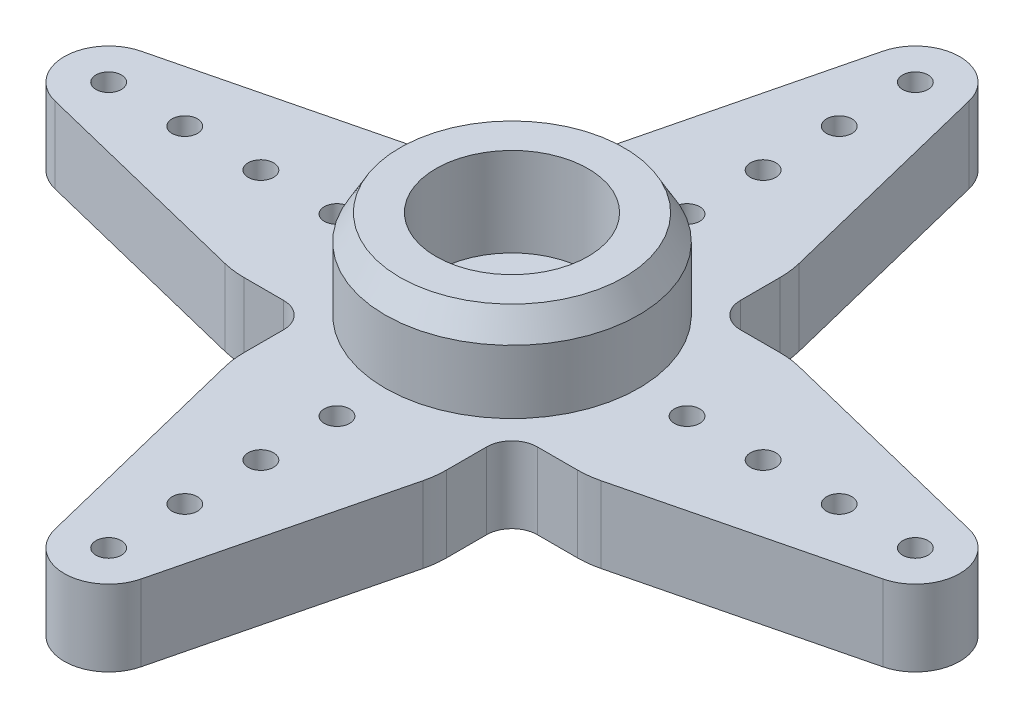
from build123d import *

# Parameters (mm, degrees)
CROQUIS1_R              = 0.5
SALIENTE_EXTRUIR1_DEPTH = 3
MATRIZC1_COUNT          = 4
CROQUIS2_R              = 5
CROQUIS2_R_2            = 3
SALIENTE_EXTRUIR2_DEPTH = 3.5
CHAFL_N1_SIZE           = 1
CHAFL_N1_SIZE2          = 0.577350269
REDONDEO1_R             = 1


with BuildPart() as part:
    # Croquis1 → Saliente-Extruir1 (new body)
    with BuildSketch(Plane(origin=(0, 0, 0), x_dir=(1, 0, 0), z_dir=(0, 1, 0))):
        with BuildLine():
            Line((-4, 0), (-4, 6.574293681))
            ThreePointArc((-4, 6.574293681), (-3.974394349, 6.996885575), (-3.897952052, 7.413294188))
            Line((-3.897952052, 7.413294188), (-1.698976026, 16.319147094))
            ThreePointArc((-1.698976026, 16.319147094), (0, 17.649646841), (1.698976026, 16.319147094))
            Line((1.698976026, 16.319147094), (3.897952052, 7.413294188))
            ThreePointArc((3.897952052, 7.413294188), (3.974394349, 6.996885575), (4, 6.574293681))
            Line((4, 6.574293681), (4, 0))
            Line((4, 0), (1.25, 0))
            ThreePointArc((1.25, 0), (0, 1.25), (-1.25, 0))
            Line((-1.25, 0), (-4, 0))
        make_face()
        with Locations(Location((0, 15.899646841, 0), (0, 0, 270))):
            Circle(CROQUIS1_R, mode=Mode.SUBTRACT)
        with Locations(Location((0, 12.899646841, 0), (0, 0, 270))):
            Circle(CROQUIS1_R, mode=Mode.SUBTRACT)
        with Locations(Location((0, 9.899646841, 0), (0, 0, 270))):
            Circle(CROQUIS1_R, mode=Mode.SUBTRACT)
        with Locations(Location((0, 6.899646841, 0), (0, 0, 270))):
            Circle(CROQUIS1_R, mode=Mode.SUBTRACT)
    saliente_extruir1 = extrude(amount=SALIENTE_EXTRUIR1_DEPTH)

    # MatrizC1: Saliente-Extruir1 ×4 about axis
    matrizc1_axis = Axis((0, 0, 0), (0, 1, 0))
    for i in range(1, MATRIZC1_COUNT):
        add(saliente_extruir1.rotate(matrizc1_axis, i * 360 / MATRIZC1_COUNT))

    # Croquis2 → Saliente-Extruir2 (add)
    with BuildSketch(Plane(origin=(0, 3, 0), x_dir=(1, 0, 0), z_dir=(0, 1, 0))):
        with Locations(Location((0, 0, 0), (0, 0, 270))):
            Circle(CROQUIS2_R)
        with Locations(Location((0, 0, 0), (0, 0, 270))):
            Circle(CROQUIS2_R_2, mode=Mode.SUBTRACT)
    extrude(amount=SALIENTE_EXTRUIR2_DEPTH)

    # Chafl_n1
    chafl_n1_edges = [part.edges().sort_by_distance(p)[0] for p in [
        (0, 6.5, -5),
    ]]
    chafl_n1_side = [part.faces().sort_by_distance(p)[0] for p in [
        (0, 4.75, -5),
    ]]
    chamfer(chafl_n1_edges, length=CHAFL_N1_SIZE, length2=CHAFL_N1_SIZE2, reference=chafl_n1_side[0])

    # Redondeo1
    redondeo1_edges = [part.edges().sort_by_distance(p)[0] for p in [
        (-4, 1.5, -4),
        (4, 1.5, -4),
        (4, 1.5, 4),
        (-4, 1.5, 4),
    ]]
    fillet(redondeo1_edges, radius=REDONDEO1_R)


solid = part.part
